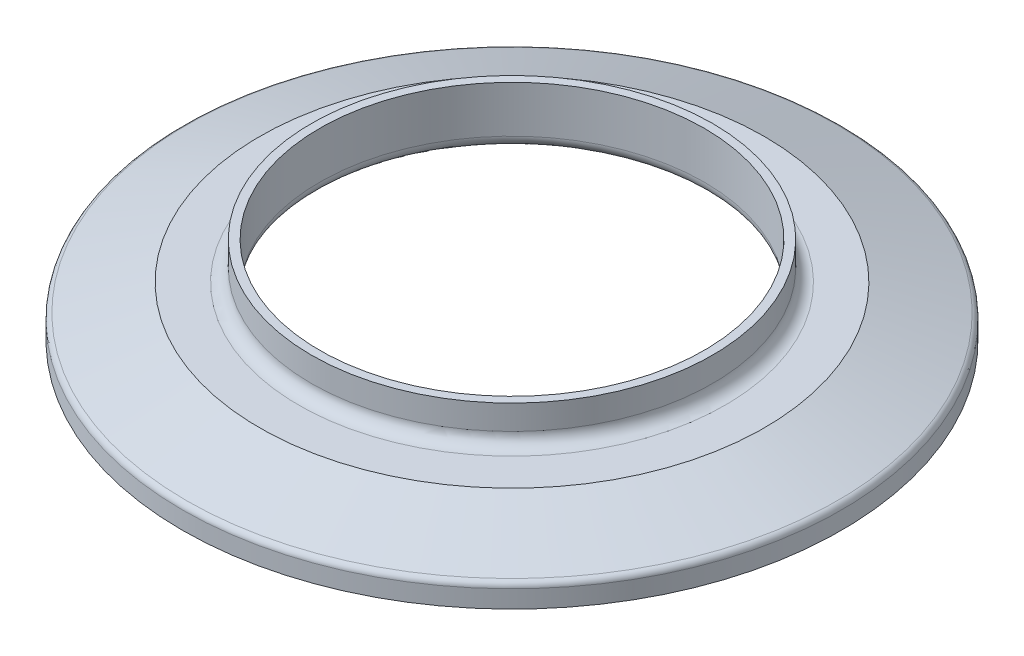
ISO-10303-21;
HEADER;
FILE_DESCRIPTION(('STEP AP214'),'2;1');
FILE_NAME('part.step','',(''),(''),'','','');
FILE_SCHEMA(('AUTOMOTIVE_DESIGN { 1 0 10303 214 1 1 1 1 }'));
ENDSEC;
DATA;
#1=APPLICATION_CONTEXT('core data for automotive mechanical design processes');
#2=APPLICATION_PROTOCOL_DEFINITION('international standard','automotive_design',2000,#1);
#3=PRODUCT_CONTEXT('',#1,'mechanical');
#4=PRODUCT('Part','Part','',(#3));
#5=PRODUCT_RELATED_PRODUCT_CATEGORY('part','',(#4));
#6=PRODUCT_DEFINITION_FORMATION('','',#4);
#7=PRODUCT_DEFINITION_CONTEXT('part definition',#1,'design');
#8=PRODUCT_DEFINITION('design','',#6,#7);
#9=PRODUCT_DEFINITION_SHAPE('','',#8);
#10=(LENGTH_UNIT() NAMED_UNIT(*) SI_UNIT(.MILLI.,.METRE.));
#11=(NAMED_UNIT(*) PLANE_ANGLE_UNIT() SI_UNIT($,.RADIAN.));
#12=(NAMED_UNIT(*) SI_UNIT($,.STERADIAN.) SOLID_ANGLE_UNIT());
#13=UNCERTAINTY_MEASURE_WITH_UNIT(LENGTH_MEASURE(1.E-05),#10,'distance_accuracy_value','');
#14=(GEOMETRIC_REPRESENTATION_CONTEXT(3) GLOBAL_UNCERTAINTY_ASSIGNED_CONTEXT((#13)) GLOBAL_UNIT_ASSIGNED_CONTEXT((#10,
#11,#12)) REPRESENTATION_CONTEXT('',''));
#15=CARTESIAN_POINT('',(0.,0.,0.));
#16=DIRECTION('',(0.,0.,1.));
#17=DIRECTION('',(1.,0.,0.));
#18=AXIS2_PLACEMENT_3D('',#15,#16,#17);
#19=CARTESIAN_POINT('',(0.,15.875,0.));
#20=DIRECTION('',(0.,-1.,0.));
#21=DIRECTION('',(0.,0.,-1.));
#22=AXIS2_PLACEMENT_3D('',#19,#20,#21);
#23=TOROIDAL_SURFACE('',#22,53.975,3.175);
#24=CARTESIAN_POINT('',(0.,12.7,0.));
#25=DIRECTION('',(0.,-1.,0.));
#26=DIRECTION('',(0.,0.,-1.));
#27=AXIS2_PLACEMENT_3D('',#24,#25,#26);
#28=CIRCLE('',#27,53.975);
#29=CARTESIAN_POINT('',(0.,12.7,-53.975));
#30=VERTEX_POINT('',#29);
#31=EDGE_CURVE('E10',#30,#30,#28,.T.);
#32=ORIENTED_EDGE('',*,*,#31,.F.);
#33=EDGE_LOOP('',(#32));
#34=FACE_BOUND('',#33,.T.);
#35=CARTESIAN_POINT('',(0.,15.875,0.));
#36=DIRECTION('',(0.,-1.,0.));
#37=DIRECTION('',(0.,0.,-1.));
#38=AXIS2_PLACEMENT_3D('',#35,#36,#37);
#39=CIRCLE('',#38,50.8);
#40=CARTESIAN_POINT('',(0.,15.875,-50.8));
#41=VERTEX_POINT('',#40);
#42=EDGE_CURVE('E86',#41,#41,#39,.T.);
#43=ORIENTED_EDGE('',*,*,#42,.T.);
#44=EDGE_LOOP('',(#43));
#45=FACE_BOUND('',#44,.T.);
#46=ADVANCED_FACE('F31',(#34,#45),#23,.F.);
#47=CARTESIAN_POINT('',(-63.8989405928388,12.7,0.));
#48=DIRECTION('',(0.,-1.,0.));
#49=DIRECTION('',(0.,0.,-1.));
#50=AXIS2_PLACEMENT_3D('',#47,#48,#49);
#51=PLANE('',#50);
#52=CARTESIAN_POINT('',(0.,12.7,0.));
#53=DIRECTION('',(0.,-1.,0.));
#54=DIRECTION('',(0.,0.,-1.));
#55=AXIS2_PLACEMENT_3D('',#52,#53,#54);
#56=CIRCLE('',#55,63.8989405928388);
#57=CARTESIAN_POINT('',(0.,12.7,-63.8989405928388));
#58=VERTEX_POINT('',#57);
#59=EDGE_CURVE('E37',#58,#58,#56,.T.);
#60=ORIENTED_EDGE('',*,*,#59,.F.);
#61=EDGE_LOOP('',(#60));
#62=FACE_BOUND('',#61,.T.);
#63=ORIENTED_EDGE('',*,*,#31,.T.);
#64=EDGE_LOOP('',(#63));
#65=FACE_BOUND('',#64,.T.);
#66=ADVANCED_FACE('F177',(#62,#65),#51,.F.);
#67=CARTESIAN_POINT('',(0.,12.7,0.));
#68=DIRECTION('',(0.,-1.,0.));
#69=DIRECTION('',(0.,0.,-1.));
#70=AXIS2_PLACEMENT_3D('',#67,#68,#69);
#71=CONICAL_SURFACE('',#70,63.8989405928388,1.22173047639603);
#72=CARTESIAN_POINT('',(0.,5.97122402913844,0.));
#73=DIRECTION('',(0.,-1.,0.));
#74=DIRECTION('',(0.,0.,-1.));
#75=AXIS2_PLACEMENT_3D('',#72,#73,#74);
#76=CIRCLE('',#75,82.3861006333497);
#77=CARTESIAN_POINT('',(0.,5.97122402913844,-82.3861006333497));
#78=VERTEX_POINT('',#77);
#79=EDGE_CURVE('E41',#78,#78,#76,.T.);
#80=ORIENTED_EDGE('',*,*,#79,.F.);
#81=EDGE_LOOP('',(#80));
#82=FACE_BOUND('',#81,.T.);
#83=ORIENTED_EDGE('',*,*,#59,.T.);
#84=EDGE_LOOP('',(#83));
#85=FACE_BOUND('',#84,.T.);
#86=ADVANCED_FACE('F172',(#82,#85),#71,.T.);
#87=CARTESIAN_POINT('',(0.,4.46752789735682,0.));
#88=DIRECTION('',(0.,-1.,0.));
#89=DIRECTION('',(0.,0.,-1.));
#90=AXIS2_PLACEMENT_3D('',#87,#88,#89);
#91=TOROIDAL_SURFACE('',#90,81.8388,1.6002);
#92=CARTESIAN_POINT('',(0.,4.46752789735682,0.));
#93=DIRECTION('',(0.,-1.,0.));
#94=DIRECTION('',(0.,0.,-1.));
#95=AXIS2_PLACEMENT_3D('',#92,#93,#94);
#96=CIRCLE('',#95,83.439);
#97=CARTESIAN_POINT('',(0.,4.46752789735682,-83.439));
#98=VERTEX_POINT('',#97);
#99=EDGE_CURVE('E45',#98,#98,#96,.T.);
#100=ORIENTED_EDGE('',*,*,#99,.F.);
#101=EDGE_LOOP('',(#100));
#102=FACE_BOUND('',#101,.T.);
#103=ORIENTED_EDGE('',*,*,#79,.T.);
#104=EDGE_LOOP('',(#103));
#105=FACE_BOUND('',#104,.T.);
#106=ADVANCED_FACE('F166',(#102,#105),#91,.T.);
#107=CARTESIAN_POINT('',(0.,0.,0.));
#108=DIRECTION('',(0.,-1.,0.));
#109=DIRECTION('',(0.,0.,-1.));
#110=AXIS2_PLACEMENT_3D('',#107,#108,#109);
#111=CYLINDRICAL_SURFACE('',#110,83.439);
#112=CARTESIAN_POINT('',(0.,0.,0.));
#113=DIRECTION('',(0.,-1.,0.));
#114=DIRECTION('',(0.,0.,-1.));
#115=AXIS2_PLACEMENT_3D('',#112,#113,#114);
#116=CIRCLE('',#115,83.439);
#117=CARTESIAN_POINT('',(0.,0.,-83.439));
#118=VERTEX_POINT('',#117);
#119=EDGE_CURVE('E50',#118,#118,#116,.T.);
#120=ORIENTED_EDGE('',*,*,#119,.F.);
#121=EDGE_LOOP('',(#120));
#122=FACE_BOUND('',#121,.T.);
#123=ORIENTED_EDGE('',*,*,#99,.T.);
#124=EDGE_LOOP('',(#123));
#125=FACE_BOUND('',#124,.T.);
#126=ADVANCED_FACE('F160',(#122,#125),#111,.T.);
#127=CARTESIAN_POINT('',(-80.2408414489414,0.,0.));
#128=DIRECTION('',(0.,1.,0.));
#129=DIRECTION('',(0.,0.,1.));
#130=AXIS2_PLACEMENT_3D('',#127,#128,#129);
#131=PLANE('',#130);
#132=CARTESIAN_POINT('',(0.,0.,0.));
#133=DIRECTION('',(0.,-1.,0.));
#134=DIRECTION('',(0.,0.,-1.));
#135=AXIS2_PLACEMENT_3D('',#132,#133,#134);
#136=CIRCLE('',#135,80.2408414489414);
#137=CARTESIAN_POINT('',(0.,0.,-80.2408414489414));
#138=VERTEX_POINT('',#137);
#139=EDGE_CURVE('E53',#138,#138,#136,.T.);
#140=ORIENTED_EDGE('',*,*,#139,.F.);
#141=EDGE_LOOP('',(#140));
#142=FACE_BOUND('',#141,.T.);
#143=ORIENTED_EDGE('',*,*,#119,.T.);
#144=EDGE_LOOP('',(#143));
#145=FACE_BOUND('',#144,.T.);
#146=ADVANCED_FACE('F154',(#142,#145),#131,.F.);
#147=CARTESIAN_POINT('',(0.,0.508000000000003,0.));
#148=DIRECTION('',(0.,-1.,0.));
#149=DIRECTION('',(0.,0.,-1.));
#150=AXIS2_PLACEMENT_3D('',#147,#148,#149);
#151=TOROIDAL_SURFACE('',#150,80.2408414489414,0.508);
#152=CARTESIAN_POINT('',(0.,0.309508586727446,0.));
#153=DIRECTION('',(0.,-1.,0.));
#154=DIRECTION('',(0.,0.,-1.));
#155=AXIS2_PLACEMENT_3D('',#152,#153,#154);
#156=CIRCLE('',#155,79.7732249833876);
#157=CARTESIAN_POINT('',(0.,0.309508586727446,-79.7732249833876));
#158=VERTEX_POINT('',#157);
#159=EDGE_CURVE('E56',#158,#158,#156,.T.);
#160=ORIENTED_EDGE('',*,*,#159,.F.);
#161=EDGE_LOOP('',(#160));
#162=FACE_BOUND('',#161,.T.);
#163=ORIENTED_EDGE('',*,*,#139,.T.);
#164=EDGE_LOOP('',(#163));
#165=FACE_BOUND('',#164,.T.);
#166=ADVANCED_FACE('F148',(#162,#165),#151,.T.);
#167=CARTESIAN_POINT('',(0.,0.309508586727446,0.));
#168=DIRECTION('',(0.,-1.,0.));
#169=DIRECTION('',(0.,0.,-1.));
#170=AXIS2_PLACEMENT_3D('',#167,#168,#169);
#171=CONICAL_SURFACE('',#170,79.7732249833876,0.401425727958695);
#172=CARTESIAN_POINT('',(0.,0.872854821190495,0.));
#173=DIRECTION('',(0.,-1.,0.));
#174=DIRECTION('',(0.,0.,-1.));
#175=AXIS2_PLACEMENT_3D('',#172,#173,#174);
#176=CIRCLE('',#175,79.5340986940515);
#177=CARTESIAN_POINT('',(0.,0.872854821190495,-79.5340986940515));
#178=VERTEX_POINT('',#177);
#179=EDGE_CURVE('E59',#178,#178,#176,.T.);
#180=ORIENTED_EDGE('',*,*,#179,.F.);
#181=EDGE_LOOP('',(#180));
#182=FACE_BOUND('',#181,.T.);
#183=ORIENTED_EDGE('',*,*,#159,.T.);
#184=EDGE_LOOP('',(#183));
#185=FACE_BOUND('',#184,.T.);
#186=ADVANCED_FACE('F142',(#182,#185),#171,.F.);
#187=CARTESIAN_POINT('',(0.,0.4064,0.));
#188=DIRECTION('',(0.,-1.,0.));
#189=DIRECTION('',(0.,0.,-1.));
#190=AXIS2_PLACEMENT_3D('',#187,#188,#189);
#191=TOROIDAL_SURFACE('',#190,78.4352,1.19379999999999);
#192=CARTESIAN_POINT('',(0.,0.872854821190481,0.));
#193=DIRECTION('',(0.,-1.,0.));
#194=DIRECTION('',(0.,0.,-1.));
#195=AXIS2_PLACEMENT_3D('',#192,#193,#194);
#196=CIRCLE('',#195,77.3363013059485);
#197=CARTESIAN_POINT('',(0.,0.872854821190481,-77.3363013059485));
#198=VERTEX_POINT('',#197);
#199=EDGE_CURVE('E62',#198,#198,#196,.T.);
#200=ORIENTED_EDGE('',*,*,#199,.F.);
#201=EDGE_LOOP('',(#200));
#202=FACE_BOUND('',#201,.T.);
#203=ORIENTED_EDGE('',*,*,#179,.T.);
#204=EDGE_LOOP('',(#203));
#205=FACE_BOUND('',#204,.T.);
#206=ADVANCED_FACE('F136',(#202,#205),#191,.F.);
#207=CARTESIAN_POINT('',(0.,0.872854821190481,0.));
#208=DIRECTION('',(0.,1.,0.));
#209=DIRECTION('',(0.,0.,1.));
#210=AXIS2_PLACEMENT_3D('',#207,#208,#209);
#211=CONICAL_SURFACE('',#210,77.3363013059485,0.401425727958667);
#212=CARTESIAN_POINT('',(0.,0.309508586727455,0.));
#213=DIRECTION('',(0.,-1.,0.));
#214=DIRECTION('',(0.,0.,-1.));
#215=AXIS2_PLACEMENT_3D('',#212,#213,#214);
#216=CIRCLE('',#215,77.0971750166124);
#217=CARTESIAN_POINT('',(0.,0.309508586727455,-77.0971750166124));
#218=VERTEX_POINT('',#217);
#219=EDGE_CURVE('E65',#218,#218,#216,.T.);
#220=ORIENTED_EDGE('',*,*,#219,.F.);
#221=EDGE_LOOP('',(#220));
#222=FACE_BOUND('',#221,.T.);
#223=ORIENTED_EDGE('',*,*,#199,.T.);
#224=EDGE_LOOP('',(#223));
#225=FACE_BOUND('',#224,.T.);
#226=ADVANCED_FACE('F130',(#222,#225),#211,.T.);
#227=CARTESIAN_POINT('',(0.,0.508,0.));
#228=DIRECTION('',(0.,-1.,0.));
#229=DIRECTION('',(0.,0.,-1.));
#230=AXIS2_PLACEMENT_3D('',#227,#228,#229);
#231=TOROIDAL_SURFACE('',#230,76.6295585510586,0.507999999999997);
#232=CARTESIAN_POINT('',(0.,0.,0.));
#233=DIRECTION('',(0.,-1.,0.));
#234=DIRECTION('',(0.,0.,-1.));
#235=AXIS2_PLACEMENT_3D('',#232,#233,#234);
#236=CIRCLE('',#235,76.6295585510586);
#237=CARTESIAN_POINT('',(0.,0.,-76.6295585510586));
#238=VERTEX_POINT('',#237);
#239=EDGE_CURVE('E68',#238,#238,#236,.T.);
#240=ORIENTED_EDGE('',*,*,#239,.F.);
#241=EDGE_LOOP('',(#240));
#242=FACE_BOUND('',#241,.T.);
#243=ORIENTED_EDGE('',*,*,#219,.T.);
#244=EDGE_LOOP('',(#243));
#245=FACE_BOUND('',#244,.T.);
#246=ADVANCED_FACE('F124',(#242,#245),#231,.T.);
#247=CARTESIAN_POINT('',(-73.406,0.,0.));
#248=DIRECTION('',(0.,1.,0.));
#249=DIRECTION('',(0.,0.,1.));
#250=AXIS2_PLACEMENT_3D('',#247,#248,#249);
#251=PLANE('',#250);
#252=CARTESIAN_POINT('',(0.,0.,0.));
#253=DIRECTION('',(0.,-1.,0.));
#254=DIRECTION('',(0.,0.,-1.));
#255=AXIS2_PLACEMENT_3D('',#252,#253,#254);
#256=CIRCLE('',#255,73.406);
#257=CARTESIAN_POINT('',(0.,0.,-73.406));
#258=VERTEX_POINT('',#257);
#259=EDGE_CURVE('E71',#258,#258,#256,.T.);
#260=ORIENTED_EDGE('',*,*,#259,.F.);
#261=EDGE_LOOP('',(#260));
#262=FACE_BOUND('',#261,.T.);
#263=ORIENTED_EDGE('',*,*,#239,.T.);
#264=EDGE_LOOP('',(#263));
#265=FACE_BOUND('',#264,.T.);
#266=ADVANCED_FACE('F118',(#262,#265),#251,.F.);
#267=CARTESIAN_POINT('',(0.,0.,0.));
#268=DIRECTION('',(0.,-1.,0.));
#269=DIRECTION('',(0.,0.,-1.));
#270=AXIS2_PLACEMENT_3D('',#267,#268,#269);
#271=CONICAL_SURFACE('',#270,73.406,1.25871400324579);
#272=CARTESIAN_POINT('',(0.,7.26359779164,0.));
#273=DIRECTION('',(0.,-1.,0.));
#274=DIRECTION('',(0.,0.,-1.));
#275=AXIS2_PLACEMENT_3D('',#272,#273,#274);
#276=CIRCLE('',#275,50.8919446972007);
#277=CARTESIAN_POINT('',(0.,7.26359779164,-50.8919446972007));
#278=VERTEX_POINT('',#277);
#279=EDGE_CURVE('E74',#278,#278,#276,.T.);
#280=ORIENTED_EDGE('',*,*,#279,.F.);
#281=EDGE_LOOP('',(#280));
#282=FACE_BOUND('',#281,.T.);
#283=ORIENTED_EDGE('',*,*,#259,.T.);
#284=EDGE_LOOP('',(#283));
#285=FACE_BOUND('',#284,.T.);
#286=ADVANCED_FACE('F112',(#282,#285),#271,.F.);
#287=CARTESIAN_POINT('',(0.,10.2852334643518,0.));
#288=DIRECTION('',(0.,-1.,0.));
#289=DIRECTION('',(0.,0.,-1.));
#290=AXIS2_PLACEMENT_3D('',#287,#288,#289);
#291=TOROIDAL_SURFACE('',#290,51.8668,3.175);
#292=CARTESIAN_POINT('',(0.,10.2852334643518,0.));
#293=DIRECTION('',(0.,-1.,0.));
#294=DIRECTION('',(0.,0.,-1.));
#295=AXIS2_PLACEMENT_3D('',#292,#293,#294);
#296=CIRCLE('',#295,48.6918);
#297=CARTESIAN_POINT('',(0.,10.2852334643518,-48.6918));
#298=VERTEX_POINT('',#297);
#299=EDGE_CURVE('E77',#298,#298,#296,.T.);
#300=ORIENTED_EDGE('',*,*,#299,.F.);
#301=EDGE_LOOP('',(#300));
#302=FACE_BOUND('',#301,.T.);
#303=ORIENTED_EDGE('',*,*,#279,.T.);
#304=EDGE_LOOP('',(#303));
#305=FACE_BOUND('',#304,.T.);
#306=ADVANCED_FACE('F106',(#302,#305),#291,.T.);
#307=CARTESIAN_POINT('',(0.,0.,0.));
#308=DIRECTION('',(0.,-1.,0.));
#309=DIRECTION('',(0.,0.,-1.));
#310=AXIS2_PLACEMENT_3D('',#307,#308,#309);
#311=CYLINDRICAL_SURFACE('',#310,48.6918);
#312=CARTESIAN_POINT('',(0.,22.098,0.));
#313=DIRECTION('',(0.,-1.,0.));
#314=DIRECTION('',(0.,0.,-1.));
#315=AXIS2_PLACEMENT_3D('',#312,#313,#314);
#316=CIRCLE('',#315,48.6918);
#317=CARTESIAN_POINT('',(0.,22.098,-48.6918));
#318=VERTEX_POINT('',#317);
#319=EDGE_CURVE('E80',#318,#318,#316,.T.);
#320=ORIENTED_EDGE('',*,*,#319,.F.);
#321=EDGE_LOOP('',(#320));
#322=FACE_BOUND('',#321,.T.);
#323=ORIENTED_EDGE('',*,*,#299,.T.);
#324=EDGE_LOOP('',(#323));
#325=FACE_BOUND('',#324,.T.);
#326=ADVANCED_FACE('F100',(#322,#325),#311,.F.);
#327=CARTESIAN_POINT('',(-50.8,22.098,0.));
#328=DIRECTION('',(0.,-1.,0.));
#329=DIRECTION('',(0.,0.,-1.));
#330=AXIS2_PLACEMENT_3D('',#327,#328,#329);
#331=PLANE('',#330);
#332=CARTESIAN_POINT('',(0.,22.098,0.));
#333=DIRECTION('',(0.,-1.,0.));
#334=DIRECTION('',(0.,0.,-1.));
#335=AXIS2_PLACEMENT_3D('',#332,#333,#334);
#336=CIRCLE('',#335,50.8);
#337=CARTESIAN_POINT('',(0.,22.098,-50.8));
#338=VERTEX_POINT('',#337);
#339=EDGE_CURVE('E83',#338,#338,#336,.T.);
#340=ORIENTED_EDGE('',*,*,#339,.F.);
#341=EDGE_LOOP('',(#340));
#342=FACE_BOUND('',#341,.T.);
#343=ORIENTED_EDGE('',*,*,#319,.T.);
#344=EDGE_LOOP('',(#343));
#345=FACE_BOUND('',#344,.T.);
#346=ADVANCED_FACE('F94',(#342,#345),#331,.F.);
#347=CARTESIAN_POINT('',(0.,0.,0.));
#348=DIRECTION('',(0.,-1.,0.));
#349=DIRECTION('',(0.,0.,-1.));
#350=AXIS2_PLACEMENT_3D('',#347,#348,#349);
#351=CYLINDRICAL_SURFACE('',#350,50.8);
#352=ORIENTED_EDGE('',*,*,#42,.F.);
#353=EDGE_LOOP('',(#352));
#354=FACE_BOUND('',#353,.T.);
#355=ORIENTED_EDGE('',*,*,#339,.T.);
#356=EDGE_LOOP('',(#355));
#357=FACE_BOUND('',#356,.T.);
#358=ADVANCED_FACE('F91',(#354,#357),#351,.T.);
#359=CLOSED_SHELL('',(#46,#66,#86,#106,#126,#146,#166,#186,#206,#226,#246,#266,#286,#306,#326,
#346,#358));
#360=MANIFOLD_SOLID_BREP('B2',#359);
#361=ADVANCED_BREP_SHAPE_REPRESENTATION('',(#18,#360),#14);
#362=SHAPE_DEFINITION_REPRESENTATION(#9,#361);
ENDSEC;
END-ISO-10303-21;
